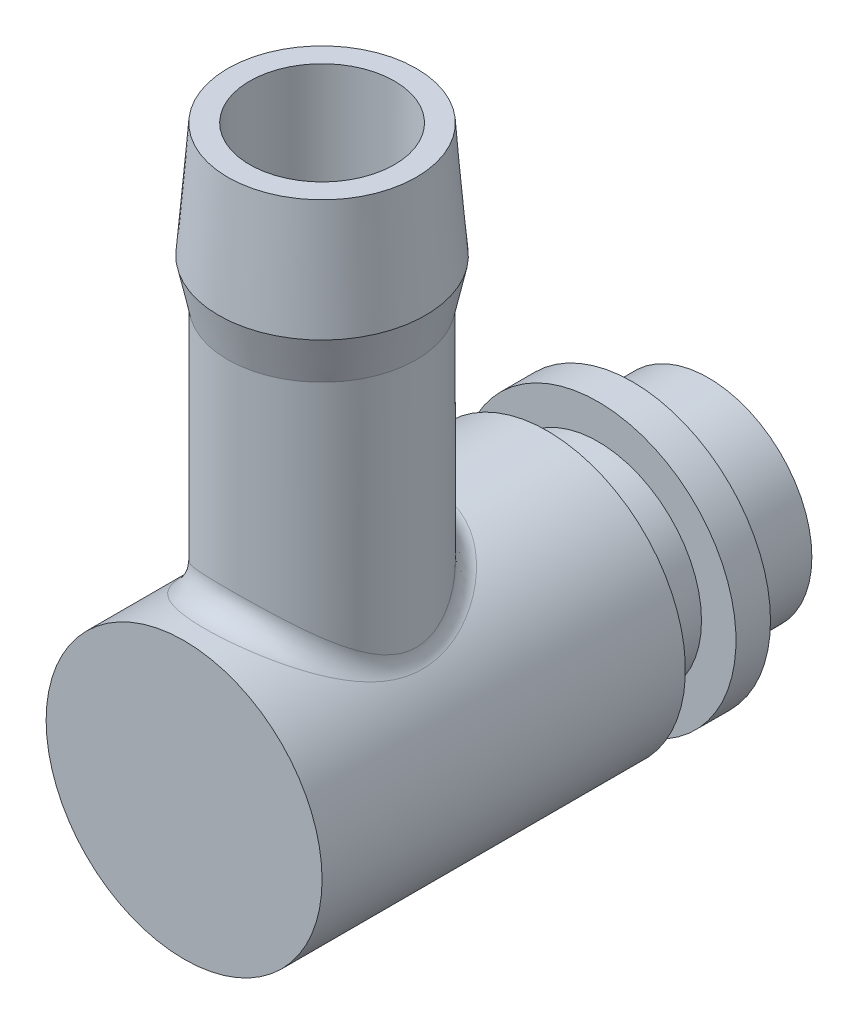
ISO-10303-21;
HEADER;
FILE_DESCRIPTION(('STEP AP214'),'2;1');
FILE_NAME('part.step','',(''),(''),'','','');
FILE_SCHEMA(('AUTOMOTIVE_DESIGN { 1 0 10303 214 1 1 1 1 }'));
ENDSEC;
DATA;
#1=APPLICATION_CONTEXT('core data for automotive mechanical design processes');
#2=APPLICATION_PROTOCOL_DEFINITION('international standard','automotive_design',2000,#1);
#3=PRODUCT_CONTEXT('',#1,'mechanical');
#4=PRODUCT('Part','Part','',(#3));
#5=PRODUCT_RELATED_PRODUCT_CATEGORY('part','',(#4));
#6=PRODUCT_DEFINITION_FORMATION('','',#4);
#7=PRODUCT_DEFINITION_CONTEXT('part definition',#1,'design');
#8=PRODUCT_DEFINITION('design','',#6,#7);
#9=PRODUCT_DEFINITION_SHAPE('','',#8);
#10=(LENGTH_UNIT() NAMED_UNIT(*) SI_UNIT(.MILLI.,.METRE.));
#11=(NAMED_UNIT(*) PLANE_ANGLE_UNIT() SI_UNIT($,.RADIAN.));
#12=(NAMED_UNIT(*) SI_UNIT($,.STERADIAN.) SOLID_ANGLE_UNIT());
#13=UNCERTAINTY_MEASURE_WITH_UNIT(LENGTH_MEASURE(1.E-05),#10,'distance_accuracy_value','');
#14=(GEOMETRIC_REPRESENTATION_CONTEXT(3) GLOBAL_UNCERTAINTY_ASSIGNED_CONTEXT((#13)) GLOBAL_UNIT_ASSIGNED_CONTEXT((#10,
#11,#12)) REPRESENTATION_CONTEXT('',''));
#15=CARTESIAN_POINT('',(0.,0.,0.));
#16=DIRECTION('',(0.,0.,1.));
#17=DIRECTION('',(1.,0.,0.));
#18=AXIS2_PLACEMENT_3D('',#15,#16,#17);
#19=CARTESIAN_POINT('',(0.,0.,19.5));
#20=DIRECTION('',(0.,0.,-1.));
#21=DIRECTION('',(-1.,0.,0.));
#22=AXIS2_PLACEMENT_3D('',#19,#20,#21);
#23=CYLINDRICAL_SURFACE('',#22,6.);
#24=CARTESIAN_POINT('',(-0.169180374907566,5.99761435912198,8.4038208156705));
#25=CARTESIAN_POINT('',(-0.130551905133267,5.99870398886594,9.40198238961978));
#26=CARTESIAN_POINT('',(-0.158675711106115,6.99721675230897,9.40307163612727));
#27=CARTESIAN_POINT('',(0.0357757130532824,6.00339383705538,8.39456243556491));
#28=CARTESIAN_POINT('',(0.0280242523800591,6.00185648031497,9.39716141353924));
#29=CARTESIAN_POINT('',(0.0335543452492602,7.00395947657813,9.39562862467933));
#30=CARTESIAN_POINT('',(0.241609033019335,5.99860532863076,8.40220558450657));
#31=CARTESIAN_POINT('',(0.185281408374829,5.99935491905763,9.40099112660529));
#32=CARTESIAN_POINT('',(0.22660716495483,6.99837288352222,9.40177311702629));
#33=CARTESIAN_POINT('',(0.648810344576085,5.96831379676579,8.45083193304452));
#34=CARTESIAN_POINT('',(0.502998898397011,5.98258117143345,9.42663614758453));
#35=CARTESIAN_POINT('',(0.60852473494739,6.96303276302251,9.44086488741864));
#36=CARTESIAN_POINT('',(0.850176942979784,5.94280440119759,8.49182538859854));
#37=CARTESIAN_POINT('',(0.661973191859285,5.96846274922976,9.44821643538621));
#38=CARTESIAN_POINT('',(0.797388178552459,6.93327180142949,9.47382041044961));
#39=CARTESIAN_POINT('',(1.23919837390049,5.87390086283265,8.60372600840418));
#40=CARTESIAN_POINT('',(0.98007510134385,5.92722510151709,9.51133272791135));
#41=CARTESIAN_POINT('',(1.16225468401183,6.85288433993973,9.563779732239));
#42=CARTESIAN_POINT('',(1.42704133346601,5.83085666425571,8.67404846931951));
#43=CARTESIAN_POINT('',(1.13793412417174,5.90069785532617,9.55196079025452));
#44=CARTESIAN_POINT('',(1.33843419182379,6.80266610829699,9.62031347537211));
#45=CARTESIAN_POINT('',(1.78948723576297,5.73002323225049,8.84133935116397));
#46=CARTESIAN_POINT('',(1.45376171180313,5.83381402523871,9.65517724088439));
#47=CARTESIAN_POINT('',(1.67837528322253,6.68502710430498,9.7548022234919));
#48=CARTESIAN_POINT('',(1.96408741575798,5.67223093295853,8.93831331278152));
#49=CARTESIAN_POINT('',(1.61099407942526,5.79388398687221,9.71709524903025));
#50=CARTESIAN_POINT('',(1.84213427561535,6.61760275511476,9.83276168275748));
#51=CARTESIAN_POINT('',(2.31774096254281,5.53787186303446,9.16865371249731));
#52=CARTESIAN_POINT('',(1.93915775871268,5.69535687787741,9.87230615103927));
#53=CARTESIAN_POINT('',(2.17382894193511,6.46085050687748,10.017937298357));
#54=CARTESIAN_POINT('',(2.49482378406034,5.45988558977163,9.30498754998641));
#55=CARTESIAN_POINT('',(2.10962242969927,5.63548938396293,9.96779113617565));
#56=CARTESIAN_POINT('',(2.33991642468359,6.36986652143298,10.1275390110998));
#57=CARTESIAN_POINT('',(2.82794790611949,5.29502499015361,9.60321794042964));
#58=CARTESIAN_POINT('',(2.43867371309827,5.50232605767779,10.1867653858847));
#59=CARTESIAN_POINT('',(2.65235636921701,6.17752915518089,10.3672928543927));
#60=CARTESIAN_POINT('',(2.98396818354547,5.20814193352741,9.76513968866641));
#61=CARTESIAN_POINT('',(2.5974844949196,5.42939502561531,10.3095068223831));
#62=CARTESIAN_POINT('',(2.7986891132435,6.07616558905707,10.4974652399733));
#63=CARTESIAN_POINT('',(3.21520787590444,5.06682291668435,10.0416433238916));
#64=CARTESIAN_POINT('',(2.83810607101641,5.30602074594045,10.527202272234));
#65=CARTESIAN_POINT('',(3.01557078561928,5.91129340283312,10.7197524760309));
#66=CARTESIAN_POINT('',(3.29760980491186,5.01345572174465,10.1489296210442));
#67=CARTESIAN_POINT('',(2.92456126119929,5.25879370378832,10.6125637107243));
#68=CARTESIAN_POINT('',(3.09285625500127,5.84903167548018,10.8060022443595));
#69=CARTESIAN_POINT('',(3.45428765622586,4.90682051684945,10.3711394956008));
#70=CARTESIAN_POINT('',(3.09033893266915,5.16297499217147,10.7919541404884));
#71=CARTESIAN_POINT('',(3.23980574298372,5.7246239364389,10.9846415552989));
#72=CARTESIAN_POINT('',(3.52857020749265,4.85355246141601,10.4860567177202));
#73=CARTESIAN_POINT('',(3.16982652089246,5.11436836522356,10.8859214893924));
#74=CARTESIAN_POINT('',(3.30947597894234,5.6624778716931,11.0770259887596));
#75=CARTESIAN_POINT('',(3.73906811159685,4.69573791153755,10.8421828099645));
#76=CARTESIAN_POINT('',(3.39509240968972,4.96945822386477,11.1787992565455));
#77=CARTESIAN_POINT('',(3.50690375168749,5.47836089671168,11.3633234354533));
#78=CARTESIAN_POINT('',(3.86302119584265,4.59312524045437,11.0948706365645));
#79=CARTESIAN_POINT('',(3.53168607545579,4.87186715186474,11.3924776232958));
#80=CARTESIAN_POINT('',(3.62316040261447,5.35864611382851,11.566464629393));
#81=CARTESIAN_POINT('',(4.04814948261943,4.4298754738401,11.5625550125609));
#82=CARTESIAN_POINT('',(3.73677265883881,4.71444939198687,11.7946680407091));
#83=CARTESIAN_POINT('',(3.79679379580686,5.16818805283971,11.9424461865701));
#84=CARTESIAN_POINT('',(4.11726996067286,4.36513932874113,11.7713596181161));
#85=CARTESIAN_POINT('',(3.81410521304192,4.65113339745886,11.9758933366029));
#86=CARTESIAN_POINT('',(3.86162247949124,5.09266255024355,12.1103087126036));
#87=CARTESIAN_POINT('',(4.23230995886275,4.253707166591,12.2038296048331));
#88=CARTESIAN_POINT('',(3.94280545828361,4.54178210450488,12.3535421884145));
#89=CARTESIAN_POINT('',(3.96951947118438,4.96265836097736,12.4579806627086));
#90=CARTESIAN_POINT('',(4.27827454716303,4.20697614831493,12.4274651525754));
#91=CARTESIAN_POINT('',(3.99476601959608,4.49530427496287,12.5505353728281));
#92=CARTESIAN_POINT('',(4.01263004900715,4.90813883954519,12.6377661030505));
#93=CARTESIAN_POINT('',(4.32782730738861,4.15577456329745,12.7719031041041));
#94=CARTESIAN_POINT('',(4.0507180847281,4.44436230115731,12.8549762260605));
#95=CARTESIAN_POINT('',(4.05910600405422,4.84840365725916,12.9146672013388));
#96=CARTESIAN_POINT('',(4.34113418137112,4.14182910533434,12.8889992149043));
#97=CARTESIAN_POINT('',(4.06575901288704,4.43045738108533,12.9585868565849));
#98=CARTESIAN_POINT('',(4.07158663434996,4.83213395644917,13.0088032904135));
#99=CARTESIAN_POINT('',(4.36076833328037,4.1211541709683,13.1248784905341));
#100=CARTESIAN_POINT('',(4.08793512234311,4.40985181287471,13.1673953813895));
#101=CARTESIAN_POINT('',(4.09000167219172,4.80801319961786,13.1984317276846));
#102=CARTESIAN_POINT('',(4.36709601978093,4.11442427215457,13.2436615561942));
#103=CARTESIAN_POINT('',(4.09510050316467,4.40312337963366,13.2727296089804));
#104=CARTESIAN_POINT('',(4.09593646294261,4.80016165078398,13.2939239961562));
#105=CARTESIAN_POINT('',(4.37259009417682,4.10858531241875,13.4816444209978));
#106=CARTESIAN_POINT('',(4.10131236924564,4.39729474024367,13.483689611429));
#107=CARTESIAN_POINT('',(4.10108940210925,4.79334953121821,13.4852435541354));
#108=CARTESIAN_POINT('',(4.37176052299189,4.10947195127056,13.6008439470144));
#109=CARTESIAN_POINT('',(4.10037201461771,4.39818217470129,13.5894604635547));
#110=CARTESIAN_POINT('',(4.10031134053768,4.79438394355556,13.5810706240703));
#111=CARTESIAN_POINT('',(4.36298460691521,4.11878591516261,13.8384467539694));
#112=CARTESIAN_POINT('',(4.09045211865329,4.40747701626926,13.8000499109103));
#113=CARTESIAN_POINT('',(4.09208033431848,4.80525023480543,13.772084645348));
#114=CARTESIAN_POINT('',(4.35503864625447,4.12721283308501,13.9568500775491));
#115=CARTESIAN_POINT('',(4.08145939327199,4.41589676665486,13.9050123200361));
#116=CARTESIAN_POINT('',(4.0846277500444,4.81508163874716,13.8672716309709));
#117=CARTESIAN_POINT('',(4.32441985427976,4.15935242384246,14.2719031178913));
#118=CARTESIAN_POINT('',(4.04685451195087,4.44793846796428,14.1839463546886));
#119=CARTESIAN_POINT('',(4.05591012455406,4.85257782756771,14.1205495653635));
#120=CARTESIAN_POINT('',(4.29540053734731,4.18956907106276,14.4668742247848));
#121=CARTESIAN_POINT('',(4.01399835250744,4.47809593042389,14.356344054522));
#122=CARTESIAN_POINT('',(4.02869266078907,4.88783058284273,14.277291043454));
#123=CARTESIAN_POINT('',(4.21943483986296,4.26605499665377,14.8474613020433));
#124=CARTESIAN_POINT('',(3.92862351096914,4.55371087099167,14.6908643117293));
#125=CARTESIAN_POINT('',(3.95744378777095,4.97706416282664,14.5832532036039));
#126=CARTESIAN_POINT('',(4.17246676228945,4.31234369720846,15.0330656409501));
#127=CARTESIAN_POINT('',(3.87579355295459,4.59942588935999,14.8534570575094));
#128=CARTESIAN_POINT('',(3.91339202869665,5.03106764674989,14.7324645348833));
#129=CARTESIAN_POINT('',(4.03423801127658,4.44273658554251,15.4852779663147));
#130=CARTESIAN_POINT('',(3.72123141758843,4.72703069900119,15.247462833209));
#131=CARTESIAN_POINT('',(3.78374610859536,5.18319268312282,15.0960077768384));
#132=CARTESIAN_POINT('',(3.93261087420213,4.53407066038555,15.7447350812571));
#133=CARTESIAN_POINT('',(3.60788681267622,4.81567633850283,15.4708212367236));
#134=CARTESIAN_POINT('',(3.68842915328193,5.28974910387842,15.3045909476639));
#135=CARTESIAN_POINT('',(3.69686343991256,4.72827904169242,16.2363541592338));
#136=CARTESIAN_POINT('',(3.34998401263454,4.9995639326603,15.8866895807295));
#137=CARTESIAN_POINT('',(3.46731963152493,5.51632554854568,15.6998141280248));
#138=CARTESIAN_POINT('',(3.56267444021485,4.83117749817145,16.4684568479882));
#139=CARTESIAN_POINT('',(3.20403432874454,5.09540955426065,16.0794293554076));
#140=CARTESIAN_POINT('',(3.34146262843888,5.63637374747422,15.8864064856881));
#141=CARTESIAN_POINT('',(3.26019738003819,5.04042034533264,16.9094874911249));
#142=CARTESIAN_POINT('',(2.88285452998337,5.28442198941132,16.4371679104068));
#143=CARTESIAN_POINT('',(3.05776682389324,5.88049040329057,16.240960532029));
#144=CARTESIAN_POINT('',(3.09112640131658,5.14678565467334,17.1176727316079));
#145=CARTESIAN_POINT('',(2.70581092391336,5.37755347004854,16.6008443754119));
#146=CARTESIAN_POINT('',(2.89919371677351,6.00458326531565,16.4083251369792));
#147=CARTESIAN_POINT('',(2.72268838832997,5.35081206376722,17.5003219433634));
#148=CARTESIAN_POINT('',(2.33245768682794,5.54901457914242,16.8918940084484));
#149=CARTESIAN_POINT('',(2.55363257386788,6.24261407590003,16.715945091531));
#150=CARTESIAN_POINT('',(2.52336756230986,5.44848608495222,17.6748364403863));
#151=CARTESIAN_POINT('',(2.13540356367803,5.62697036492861,17.0182943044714));
#152=CARTESIAN_POINT('',(2.36668787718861,6.35656709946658,16.8562410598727));
#153=CARTESIAN_POINT('',(2.12869823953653,5.61313547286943,17.9614337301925));
#154=CARTESIAN_POINT('',(1.76157974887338,5.75172561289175,17.2170553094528));
#155=CARTESIAN_POINT('',(1.99652416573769,6.54865805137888,17.0866428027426));
#156=CARTESIAN_POINT('',(1.93726709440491,5.68251865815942,18.078959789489));
#157=CARTESIAN_POINT('',(1.58565395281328,5.80111395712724,17.2940586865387));
#158=CARTESIAN_POINT('',(1.81697926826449,6.62960510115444,17.1811245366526));
#159=CARTESIAN_POINT('',(1.53655983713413,5.8036698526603,18.2813194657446));
#160=CARTESIAN_POINT('',(1.23098829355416,5.88353479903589,17.421719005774));
#161=CARTESIAN_POINT('',(1.44115252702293,6.77094816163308,17.3438058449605));
#162=CARTESIAN_POINT('',(1.32728614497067,5.85544024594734,18.366157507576));
#163=CARTESIAN_POINT('',(1.05313804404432,5.9159490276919,17.4713938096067));
#164=CARTESIAN_POINT('',(1.24487295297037,6.83134695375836,17.4120089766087));
#165=CARTESIAN_POINT('',(1.00324909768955,5.91657027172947,18.4656113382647));
#166=CARTESIAN_POINT('',(0.787483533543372,5.95275783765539,17.5277482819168));
#167=CARTESIAN_POINT('',(0.940955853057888,6.90266531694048,17.4919620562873));
#168=CARTESIAN_POINT('',(0.893048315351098,5.93423284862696,18.494191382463));
#169=CARTESIAN_POINT('',(0.698459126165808,5.96306019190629,17.5435085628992));
#170=CARTESIAN_POINT('',(0.837597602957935,6.92327165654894,17.514938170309));
#171=CARTESIAN_POINT('',(0.6703198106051,5.96349299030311,18.5414093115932));
#172=CARTESIAN_POINT('',(0.520773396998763,5.97986404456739,17.5692087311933));
#173=CARTESIAN_POINT('',(0.628698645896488,6.95740848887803,17.5528976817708));
#174=CARTESIAN_POINT('',(0.557793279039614,5.97509358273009,18.560052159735));
#175=CARTESIAN_POINT('',(0.432343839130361,5.98632096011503,17.5790803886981));
#176=CARTESIAN_POINT('',(0.523159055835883,6.97094251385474,17.5678850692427));
#177=CARTESIAN_POINT('',(0.33158816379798,5.99190272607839,18.5870342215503));
#178=CARTESIAN_POINT('',(0.255880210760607,5.99561800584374,17.5932967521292));
#179=CARTESIAN_POINT('',(0.310999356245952,6.99055318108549,17.5895765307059));
#180=CARTESIAN_POINT('',(0.217912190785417,5.99712344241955,18.5953930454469));
#181=CARTESIAN_POINT('',(0.168097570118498,5.99843806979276,17.5976107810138));
#182=CARTESIAN_POINT('',(0.204381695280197,6.99664401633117,17.5962963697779));
#183=CARTESIAN_POINT('',(-0.00971032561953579,6.00107025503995,18.601714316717));
#184=CARTESIAN_POINT('',(-0.00756882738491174,6.00058247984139,17.6008910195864));
#185=CARTESIAN_POINT('',(-0.0091073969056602,7.0012486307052,17.6013781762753));
#186=CARTESIAN_POINT('',(-0.123656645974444,5.99980055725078,18.5996834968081));
#187=CARTESIAN_POINT('',(-0.095191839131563,5.99990275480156,17.599851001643));
#188=CARTESIAN_POINT('',(-0.115978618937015,6.99976731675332,17.599745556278));
#189=CARTESIAN_POINT('',(-0.30105623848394,5.99278377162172,18.5884389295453));
#190=CARTESIAN_POINT('',(-0.23252148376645,5.99607026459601,17.5939893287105));
#191=CARTESIAN_POINT('',(-0.282363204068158,6.99158106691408,17.5907058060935));
#192=CARTESIAN_POINT('',(-0.364783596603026,5.98923931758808,18.5827576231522));
#193=CARTESIAN_POINT('',(-0.281941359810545,5.99413421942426,17.5910283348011));
#194=CARTESIAN_POINT('',(-0.34213363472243,6.98744587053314,17.5861384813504));
#195=CARTESIAN_POINT('',(-0.491806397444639,5.98014886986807,18.5681679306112));
#196=CARTESIAN_POINT('',(-0.380947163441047,5.98911409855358,17.583351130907));
#197=CARTESIAN_POINT('',(-0.461269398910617,6.97684034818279,17.5744095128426));
#198=CARTESIAN_POINT('',(-0.555101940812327,5.9746033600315,18.5592603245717));
#199=CARTESIAN_POINT('',(-0.430488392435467,5.98603490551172,17.5786423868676));
#200=CARTESIAN_POINT('',(-0.520634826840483,6.97037058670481,17.5672484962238));
#201=CARTESIAN_POINT('',(-0.731447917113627,5.9563367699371,18.5298711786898));
#202=CARTESIAN_POINT('',(-0.569315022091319,5.97577043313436,17.5629476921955));
#203=CARTESIAN_POINT('',(-0.686031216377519,6.94905956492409,17.5436219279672));
#204=CARTESIAN_POINT('',(-0.843858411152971,5.94142221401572,18.5058279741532));
#205=CARTESIAN_POINT('',(-0.658836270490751,5.96727905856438,17.5499659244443));
#206=CARTESIAN_POINT('',(-0.791461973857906,6.93165924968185,17.5242930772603));
#207=CARTESIAN_POINT('',(-1.06585028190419,5.90564547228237,18.4478670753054));
#208=CARTESIAN_POINT('',(-0.838677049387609,5.9462022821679,17.5177153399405));
#209=CARTESIAN_POINT('',(-0.999670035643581,6.88991971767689,17.4776970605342));
#210=CARTESIAN_POINT('',(-1.17542966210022,5.88477920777,18.4139426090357));
#211=CARTESIAN_POINT('',(-0.92877469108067,5.93367115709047,17.4985297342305));
#212=CARTESIAN_POINT('',(-1.10244546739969,6.86557574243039,17.4504244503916));
#213=CARTESIAN_POINT('',(-1.49917259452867,5.81387849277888,18.2979342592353));
#214=CARTESIAN_POINT('',(-1.19901870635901,5.88967890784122,17.4310615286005));
#215=CARTESIAN_POINT('',(-1.40608671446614,6.78285824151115,17.3571628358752));
#216=CARTESIAN_POINT('',(-1.7079538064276,5.7555846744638,18.2016821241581));
#217=CARTESIAN_POINT('',(-1.38038435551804,5.85184658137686,17.372913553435));
#218=CARTESIAN_POINT('',(-1.60190438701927,6.71484878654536,17.279783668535));
#219=CARTESIAN_POINT('',(-2.10432909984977,5.62274995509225,17.977549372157));
#220=CARTESIAN_POINT('',(-1.73869264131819,5.75840852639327,17.227302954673));
#221=CARTESIAN_POINT('',(-1.97366814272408,6.55987494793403,17.0995985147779));
#222=CARTESIAN_POINT('',(-2.292081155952,5.54834453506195,17.8499313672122));
#223=CARTESIAN_POINT('',(-1.91492412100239,5.70359989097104,17.1411347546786));
#224=CARTESIAN_POINT('',(-2.14976239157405,6.47306862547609,16.9970036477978));
#225=CARTESIAN_POINT('',(-2.64620633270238,5.38844277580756,17.5671354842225));
#226=CARTESIAN_POINT('',(-2.25734945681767,5.57866424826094,16.9395267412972));
#227=CARTESIAN_POINT('',(-2.48189940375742,6.2865165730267,16.7696579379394));
#228=CARTESIAN_POINT('',(-2.81258173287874,5.30294762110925,17.4119605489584));
#229=CARTESIAN_POINT('',(-2.42357149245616,5.50902862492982,16.8250001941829));
#230=CARTESIAN_POINT('',(-2.63794430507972,6.18677222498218,16.6449094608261));
#231=CARTESIAN_POINT('',(-3.14379239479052,5.11445060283,17.0547052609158));
#232=CARTESIAN_POINT('',(-2.76068136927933,5.34937812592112,16.5514456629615));
#233=CARTESIAN_POINT('',(-2.94858959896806,5.96685903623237,16.3577042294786));
#234=CARTESIAN_POINT('',(-3.3053848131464,5.01064381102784,16.8491204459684));
#235=CARTESIAN_POINT('',(-2.93057291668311,5.25785260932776,16.3887837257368));
#236=CARTESIAN_POINT('',(-3.10014850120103,5.84575111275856,16.1924301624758));
#237=CARTESIAN_POINT('',(-3.59836003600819,4.80456413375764,16.4092451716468));
#238=CARTESIAN_POINT('',(-3.24251847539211,5.07084705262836,16.0305319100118));
#239=CARTESIAN_POINT('',(-3.37493245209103,5.60532482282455,15.8388049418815));
#240=CARTESIAN_POINT('',(-3.7297261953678,4.70229212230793,16.1749390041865));
#241=CARTESIAN_POINT('',(-3.38577095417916,4.97517139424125,15.835209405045));
#242=CARTESIAN_POINT('',(-3.49814188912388,5.4860074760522,15.6504411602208));
#243=CARTESIAN_POINT('',(-3.94049381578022,4.5263774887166,15.7204639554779));
#244=CARTESIAN_POINT('',(-3.61722939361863,4.80779538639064,15.4490441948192));
#245=CARTESIAN_POINT('',(-3.6958226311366,5.28077373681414,15.2850788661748));
#246=CARTESIAN_POINT('',(-4.02491274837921,4.45080812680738,15.5044929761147));
#247=CARTESIAN_POINT('',(-3.71114307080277,4.73461082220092,15.2632650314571));
#248=CARTESIAN_POINT('',(-3.77499986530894,5.19260948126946,15.1114551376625));
#249=CARTESIAN_POINT('',(-4.16841235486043,4.31671282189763,15.0546962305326));
#250=CARTESIAN_POINT('',(-3.87096200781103,4.60397270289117,14.8730183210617));
#251=CARTESIAN_POINT('',(-3.90958936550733,5.03616495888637,14.7498538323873));
#252=CARTESIAN_POINT('',(-4.22754774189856,4.2581501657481,14.8209103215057));
#253=CARTESIAN_POINT('',(-3.93764288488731,4.54599700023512,14.6680165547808));
#254=CARTESIAN_POINT('',(-3.96505294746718,4.96784186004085,14.5619082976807));
#255=CARTESIAN_POINT('',(-4.30845034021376,4.17611708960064,14.3852742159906));
#256=CARTESIAN_POINT('',(-4.02872366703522,4.46472931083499,14.2843904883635));
#257=CARTESIAN_POINT('',(-4.04093218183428,4.87213660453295,14.2116910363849));
#258=CARTESIAN_POINT('',(-4.33520758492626,4.14807184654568,14.1858921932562));
#259=CARTESIAN_POINT('',(-4.05904659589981,4.43669545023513,14.1078997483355));
#260=CARTESIAN_POINT('',(-4.06602802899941,4.83941715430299,14.0514035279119));
#261=CARTESIAN_POINT('',(-4.36816545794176,4.11336250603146,13.7824052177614));
#262=CARTESIAN_POINT('',(-4.09627048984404,4.40210532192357,13.7507082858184));
#263=CARTESIAN_POINT('',(-4.09693949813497,4.79892292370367,13.7270316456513));
#264=CARTESIAN_POINT('',(-4.3743904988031,4.10667301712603,13.5783061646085));
#265=CARTESIAN_POINT('',(-4.10334625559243,4.3953878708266,13.5693263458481));
#266=CARTESIAN_POINT('',(-4.10277801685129,4.79111851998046,13.5629520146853));
#267=CARTESIAN_POINT('',(-4.36583394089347,4.11576437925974,13.1713961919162));
#268=CARTESIAN_POINT('',(-4.09367293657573,4.40446124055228,13.2086266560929));
#269=CARTESIAN_POINT('',(-4.09475274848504,4.80172510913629,13.2358283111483));
#270=CARTESIAN_POINT('',(-4.35104837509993,4.13154947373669,12.9685855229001));
#271=CARTESIAN_POINT('',(-4.07687998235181,4.42029337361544,13.0285776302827));
#272=CARTESIAN_POINT('',(-4.08088524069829,4.82014105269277,13.0727844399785));
#273=CARTESIAN_POINT('',(-4.30157235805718,4.18302533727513,12.5697223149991));
#274=CARTESIAN_POINT('',(-4.02107156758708,4.47148542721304,12.6761440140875));
#275=CARTESIAN_POINT('',(-4.03448126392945,4.88019622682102,12.752129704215));
#276=CARTESIAN_POINT('',(-4.26684981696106,4.2187481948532,12.3736812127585));
#277=CARTESIAN_POINT('',(-3.98180738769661,4.50706799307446,12.5031391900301));
#278=CARTESIAN_POINT('',(-4.00191469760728,4.92187289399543,12.5945280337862));
#279=CARTESIAN_POINT('',(-4.16397821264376,4.32066460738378,11.9247186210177));
#280=CARTESIAN_POINT('',(-3.86622765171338,4.60765937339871,12.1090494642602));
#281=CARTESIAN_POINT('',(-3.90543054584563,5.04077537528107,12.2335973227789));
#282=CARTESIAN_POINT('',(-4.08835989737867,4.3931608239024,11.6761142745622));
#283=CARTESIAN_POINT('',(-3.78123641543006,4.67899571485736,11.8923195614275));
#284=CARTESIAN_POINT('',(-3.83450748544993,5.12535429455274,12.0337389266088));
#285=CARTESIAN_POINT('',(-3.90847462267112,4.55394136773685,11.2010452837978));
#286=CARTESIAN_POINT('',(-3.58207840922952,4.83414562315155,11.4836138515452));
#287=CARTESIAN_POINT('',(-3.66579155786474,5.31293159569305,11.6518207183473));
#288=CARTESIAN_POINT('',(-3.80415816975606,4.64225287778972,10.9746198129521));
#289=CARTESIAN_POINT('',(-3.46688046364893,4.91856615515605,11.2911428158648));
#290=CARTESIAN_POINT('',(-3.56795227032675,5.41596169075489,11.4697923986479));
#291=CARTESIAN_POINT('',(-3.56590244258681,4.82781715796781,10.5383499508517));
#292=CARTESIAN_POINT('',(-3.20850535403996,5.09182603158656,10.9266830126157));
#293=CARTESIAN_POINT('',(-3.34449019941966,5.63245335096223,11.119065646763));
#294=CARTESIAN_POINT('',(-3.43116619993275,4.92525902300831,10.3292095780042));
#295=CARTESIAN_POINT('',(-3.06361033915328,5.18103502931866,10.7555407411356));
#296=CARTESIAN_POINT('',(-3.21811993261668,5.74613552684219,10.9509331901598));
#297=CARTESIAN_POINT('',(-3.13548745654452,5.11859779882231,9.93672707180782));
#298=CARTESIAN_POINT('',(-2.75316023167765,5.35268300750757,10.4420703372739));
#299=CARTESIAN_POINT('',(-2.94080032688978,5.97169743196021,10.6354080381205));
#300=CARTESIAN_POINT('',(-2.97453358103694,5.21449401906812,9.75339620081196));
#301=CARTESIAN_POINT('',(-2.58669602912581,5.43512589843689,10.3001860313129));
#302=CARTESIAN_POINT('',(-2.78984031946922,6.08357635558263,10.4880243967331));
#303=CARTESIAN_POINT('',(-2.59426165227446,5.41517279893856,9.38325126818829));
#304=CARTESIAN_POINT('',(-2.20454909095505,5.60135323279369,10.0221377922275));
#305=CARTESIAN_POINT('',(-2.43318004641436,6.31770159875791,10.1904569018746));
#306=CARTESIAN_POINT('',(-2.36966195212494,5.51821215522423,9.20232094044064));
#307=CARTESIAN_POINT('',(-1.98598735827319,5.68132304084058,9.89436554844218));
#308=CARTESIAN_POINT('',(-2.22252607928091,6.43791418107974,10.0450031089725));
#309=CARTESIAN_POINT('',(-2.0090486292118,5.65511599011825,8.96767296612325));
#310=CARTESIAN_POINT('',(-1.65362607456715,5.78107033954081,9.7373054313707));
#311=CARTESIAN_POINT('',(-1.8843037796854,6.59763532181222,9.85636454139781));
#312=CARTESIAN_POINT('',(-1.88492421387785,5.6978000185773,8.89559433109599));
#313=CARTESIAN_POINT('',(-1.54088625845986,5.81112926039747,9.69046209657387));
#314=CARTESIAN_POINT('',(-1.76788643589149,6.64743335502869,9.79841897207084));
#315=CARTESIAN_POINT('',(-1.6295024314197,5.77603131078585,8.7647776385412));
#316=CARTESIAN_POINT('',(-1.31422311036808,5.86452779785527,9.60769095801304));
#317=CARTESIAN_POINT('',(-1.52832417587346,6.73870319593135,9.69325261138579));
#318=CARTESIAN_POINT('',(-1.49820869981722,5.81158214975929,8.70603289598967));
#319=CARTESIAN_POINT('',(-1.20052395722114,5.88770946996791,9.57201549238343));
#320=CARTESIAN_POINT('',(-1.40518266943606,6.78017917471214,9.64602644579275));
#321=CARTESIAN_POINT('',(-1.17374404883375,5.88730148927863,8.58174864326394));
#322=CARTESIAN_POINT('',(-0.925213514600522,5.93576547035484,9.49821180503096));
#323=CARTESIAN_POINT('',(-1.10086451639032,6.86851840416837,9.54611165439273));
#324=CARTESIAN_POINT('',(-0.977469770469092,5.92328282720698,8.52347416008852));
#325=CARTESIAN_POINT('',(-0.765158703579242,5.95682412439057,9.46602163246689));
#326=CARTESIAN_POINT('',(-0.916777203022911,6.91049663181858,9.49926354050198));
#327=CARTESIAN_POINT('',(-0.577477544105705,5.97554648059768,8.43914458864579));
#328=CARTESIAN_POINT('',(-0.44608449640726,5.98685307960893,9.42010964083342));
#329=CARTESIAN_POINT('',(-0.541621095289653,6.97147089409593,9.43146917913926));
#330=CARTESIAN_POINT('',(-0.373765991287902,5.99184532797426,8.41306246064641));
#331=CARTESIAN_POINT('',(-0.288424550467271,5.99556548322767,9.40678197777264));
#332=CARTESIAN_POINT('',(-0.350558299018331,6.99048621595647,9.41050119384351));
#333=CARTESIAN_POINT('',(-0.169180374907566,5.99761435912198,8.4038208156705));
#334=CARTESIAN_POINT('',(-0.130551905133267,5.99870398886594,9.40198238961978));
#335=CARTESIAN_POINT('',(-0.158675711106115,6.99721675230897,9.40307163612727));
#336=(BOUNDED_SURFACE() B_SPLINE_SURFACE(3,2,((#24,#25,#26),(#27,#28,#29),(#30,#31,#32),(#33,
#34,#35),(#36,#37,#38),(#39,#40,#41),(#42,#43,#44),(#45,#46,#47),(#48,#49,#50),(#51,#52,#53),
(#54,#55,#56),(#57,#58,#59),(#60,#61,#62),(#63,#64,#65),(#66,#67,#68),(#69,#70,#71),(#72,#73,
#74),(#75,#76,#77),(#78,#79,#80),(#81,#82,#83),(#84,#85,#86),(#87,#88,#89),(#90,#91,#92),(#93,
#94,#95),(#96,#97,#98),(#99,#100,#101),(#102,#103,#104),(#105,#106,#107),(#108,#109,#110),(#111,
#112,#113),(#114,#115,#116),(#117,#118,#119),(#120,#121,#122),(#123,#124,#125),(#126,#127,#128),
(#129,#130,#131),(#132,#133,#134),(#135,#136,#137),(#138,#139,#140),(#141,#142,#143),(#144,#145,
#146),(#147,#148,#149),(#150,#151,#152),(#153,#154,#155),(#156,#157,#158),(#159,#160,#161),
(#162,#163,#164),(#165,#166,#167),(#168,#169,#170),(#171,#172,#173),(#174,#175,#176),(#177,#178,
#179),(#180,#181,#182),(#183,#184,#185),(#186,#187,#188),(#189,#190,#191),(#192,#193,#194),
(#195,#196,#197),(#198,#199,#200),(#201,#202,#203),(#204,#205,#206),(#207,#208,#209),(#210,#211,
#212),(#213,#214,#215),(#216,#217,#218),(#219,#220,#221),(#222,#223,#224),(#225,#226,#227),
(#228,#229,#230),(#231,#232,#233),(#234,#235,#236),(#237,#238,#239),(#240,#241,#242),(#243,#244,
#245),(#246,#247,#248),(#249,#250,#251),(#252,#253,#254),(#255,#256,#257),(#258,#259,#260),
(#261,#262,#263),(#264,#265,#266),(#267,#268,#269),(#270,#271,#272),(#273,#274,#275),(#276,#277,
#278),(#279,#280,#281),(#282,#283,#284),(#285,#286,#287),(#288,#289,#290),(#291,#292,#293),
(#294,#295,#296),(#297,#298,#299),(#300,#301,#302),(#303,#304,#305),(#306,#307,#308),(#309,#310,
#311),(#312,#313,#314),(#315,#316,#317),(#318,#319,#320),(#321,#322,#323),(#324,#325,#326),
(#327,#328,#329),(#330,#331,#332),(#333,#334,#335)),.UNSPECIFIED.,.T.,.F.,
.F.) B_SPLINE_SURFACE_WITH_KNOTS((4,2,2,2,2,2,2,2,2,2,2,2,2,2,2,2,2,2,2,2,2,2,2,2,2,2,2,2,2,2,2,
2,2,2,2,2,2,2,2,2,2,2,2,2,2,2,2,2,2,2,2,4),(3,3),(0.,0.71730112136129,1.43482291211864,
2.13867658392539,2.84267669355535,3.63098151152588,4.42006743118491,4.89043189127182,
5.36040941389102,6.29988946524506,7.00639916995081,7.71152843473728,8.06873775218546,
8.42592615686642,8.78291290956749,9.13988038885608,9.74017280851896,10.3411931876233,
11.2497687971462,12.1602783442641,13.0940275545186,14.0263645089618,14.8183760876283,
15.6102804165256,16.0097153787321,16.4089506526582,16.8074234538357,17.2056380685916,
17.4295805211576,17.6534688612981,18.0561836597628,18.4591751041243,19.2665152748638,
20.0673134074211,20.868026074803,21.776882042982,22.6862373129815,23.4433866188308,
24.1988890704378,24.8095764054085,25.4195373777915,26.0296135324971,26.6406744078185,
27.4671954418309,28.2951509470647,29.1480219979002,30.001264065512,31.0156819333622,
31.5226499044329,32.0293631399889,32.7459700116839,33.461974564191),(0.,1.),
.UNSPECIFIED.) GEOMETRIC_REPRESENTATION_ITEM() RATIONAL_B_SPLINE_SURFACE(((1.,0.70749249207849,
1.),(1.,0.706558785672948,1.),(1.,0.707340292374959,1.),(1.,0.712206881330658,1.),(1.,
0.716292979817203,1.),(1.,0.727043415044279,1.),(1.,0.733657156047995,1.),(1.,0.748648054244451,
1.),(1.,0.757025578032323,1.),(1.,0.775781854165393,1.),(1.,0.786280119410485,1.),(1.,
0.807487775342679,1.),(1.,0.81819736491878,1.),(1.,0.834843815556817,1.),(1.,0.840961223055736,
1.),(1.,0.85286715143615,1.),(1.,0.858655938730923,1.),(1.,0.875364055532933,1.),(1.,
0.885631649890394,1.),(1.,0.901290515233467,1.),(1.,0.907259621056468,1.),(1.,0.917294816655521,
1.),(1.,0.921364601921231,1.),(1.,0.925771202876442,1.),(1.,0.92695909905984,1.),(1.,
0.928714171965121,1.),(1.,0.929281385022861,1.),(1.,0.929773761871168,1.),(1.,0.929699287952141,
1.),(1.,0.928913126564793,1.),(1.,0.928201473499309,1.),(1.,0.925466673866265,1.),(1.,
0.922880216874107,1.),(1.,0.916175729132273,1.),(1.,0.912055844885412,1.),(1.,0.900096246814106,
1.),(1.,0.891431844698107,1.),(1.,0.871987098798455,1.),(1.,0.861202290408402,1.),(1.,
0.83803898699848,1.),(1.,0.825626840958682,1.),(1.,0.800517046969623,1.),(1.,0.787819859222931,
1.),(1.,0.765416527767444,1.),(1.,0.755547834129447,1.),(1.,0.737785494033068,1.),(1.,
0.729891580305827,1.),(1.,0.720396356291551,1.),(1.,0.717615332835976,1.),(1.,0.712976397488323,
1.),(1.,0.711118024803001,1.),(1.,0.708416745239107,1.),(1.,0.70757190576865,1.),(1.,
0.706933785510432,1.),(1.,0.707139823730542,1.),(1.,0.708272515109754,1.),(1.,0.708844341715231,
1.),(1.,0.710305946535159,1.),(1.,0.711195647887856,1.),(1.,0.714113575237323,1.),(1.,
0.716483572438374,1.),(1.,0.722100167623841,1.),(1.,0.725347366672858,1.),(1.,0.736213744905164,
1.),(1.,0.744950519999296,1.),(1.,0.764040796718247,1.),(1.,0.774380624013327,1.),(1.,
0.79561547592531,1.),(1.,0.80651044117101,1.),(1.,0.829437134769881,1.),(1.,0.841423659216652,
1.),(1.,0.864033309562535,1.),(1.,0.874655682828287,1.),(1.,0.892128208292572,1.),(1.,
0.89931215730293,1.),(1.,0.911688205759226,1.),(1.,0.916884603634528,1.),(1.,0.9240403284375,
1.),(1.,0.926429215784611,1.),(1.,0.929375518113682,1.),(1.,0.929935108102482,1.),(1.,
0.929168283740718,1.),(1.,0.927841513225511,1.),(1.,0.923433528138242,1.),(1.,0.92034948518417,
1.),(1.,0.911312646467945,1.),(1.,0.904731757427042,1.),(1.,0.889447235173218,1.),(1.,
0.880739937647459,1.),(1.,0.861520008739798,1.),(1.,0.850960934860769,1.),(1.,0.828926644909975,
1.),(1.,0.817451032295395,1.),(1.,0.792257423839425,1.),(1.,0.778525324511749,1.),(1.,
0.75941526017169,1.),(1.,0.75329453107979,1.),(1.,0.74184862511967,1.),(1.,0.736523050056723,
1.),(1.,0.724998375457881,1.),(1.,0.719351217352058,1.),(1.,0.711065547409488,1.),(1.,
0.708424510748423,1.),(1.,0.70749249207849,1.))) REPRESENTATION_ITEM('') SURFACE());
#337=CARTESIAN_POINT('',(-0.169180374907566,5.99761435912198,8.4038208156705));
#338=CARTESIAN_POINT('',(0.0357757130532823,6.00339383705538,8.39456243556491));
#339=CARTESIAN_POINT('',(0.241609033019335,5.99860532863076,8.40220558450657));
#340=CARTESIAN_POINT('',(0.648810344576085,5.96831379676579,8.45083193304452));
#341=CARTESIAN_POINT('',(0.850176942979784,5.94280440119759,8.49182538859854));
#342=CARTESIAN_POINT('',(1.23919837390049,5.87390086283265,8.60372600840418));
#343=CARTESIAN_POINT('',(1.42704133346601,5.83085666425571,8.67404846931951));
#344=CARTESIAN_POINT('',(1.78948723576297,5.73002323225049,8.84133935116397));
#345=CARTESIAN_POINT('',(1.96408741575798,5.67223093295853,8.93831331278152));
#346=CARTESIAN_POINT('',(2.31774096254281,5.53787186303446,9.16865371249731));
#347=CARTESIAN_POINT('',(2.49482378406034,5.45988558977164,9.30498754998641));
#348=CARTESIAN_POINT('',(2.8279479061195,5.29502499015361,9.60321794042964));
#349=CARTESIAN_POINT('',(2.98396818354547,5.20814193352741,9.76513968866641));
#350=CARTESIAN_POINT('',(3.21520787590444,5.06682291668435,10.0416433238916));
#351=CARTESIAN_POINT('',(3.29760980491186,5.01345572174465,10.1489296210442));
#352=CARTESIAN_POINT('',(3.45428765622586,4.90682051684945,10.3711394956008));
#353=CARTESIAN_POINT('',(3.52857020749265,4.85355246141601,10.4860567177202));
#354=CARTESIAN_POINT('',(3.73906811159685,4.69573791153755,10.8421828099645));
#355=CARTESIAN_POINT('',(3.86302119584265,4.59312524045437,11.0948706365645));
#356=CARTESIAN_POINT('',(4.04814948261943,4.4298754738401,11.5625550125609));
#357=CARTESIAN_POINT('',(4.11726996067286,4.36513932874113,11.7713596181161));
#358=CARTESIAN_POINT('',(4.23230995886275,4.253707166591,12.2038296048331));
#359=CARTESIAN_POINT('',(4.27827454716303,4.20697614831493,12.4274651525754));
#360=CARTESIAN_POINT('',(4.32782730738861,4.15577456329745,12.7719031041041));
#361=CARTESIAN_POINT('',(4.34113418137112,4.14182910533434,12.8889992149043));
#362=CARTESIAN_POINT('',(4.36076833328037,4.12115417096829,13.1248784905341));
#363=CARTESIAN_POINT('',(4.36709601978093,4.11442427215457,13.2436615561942));
#364=CARTESIAN_POINT('',(4.37259009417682,4.10858531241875,13.4816444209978));
#365=CARTESIAN_POINT('',(4.37176052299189,4.10947195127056,13.6008439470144));
#366=CARTESIAN_POINT('',(4.36298460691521,4.11878591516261,13.8384467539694));
#367=CARTESIAN_POINT('',(4.35503864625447,4.12721283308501,13.9568500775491));
#368=CARTESIAN_POINT('',(4.32441985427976,4.15935242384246,14.2719031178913));
#369=CARTESIAN_POINT('',(4.29540053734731,4.18956907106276,14.4668742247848));
#370=CARTESIAN_POINT('',(4.21943483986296,4.26605499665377,14.8474613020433));
#371=CARTESIAN_POINT('',(4.17246676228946,4.31234369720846,15.0330656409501));
#372=CARTESIAN_POINT('',(4.03423801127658,4.44273658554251,15.4852779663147));
#373=CARTESIAN_POINT('',(3.93261087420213,4.53407066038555,15.7447350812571));
#374=CARTESIAN_POINT('',(3.69686343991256,4.72827904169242,16.2363541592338));
#375=CARTESIAN_POINT('',(3.56267444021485,4.83117749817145,16.4684568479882));
#376=CARTESIAN_POINT('',(3.26019738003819,5.04042034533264,16.9094874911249));
#377=CARTESIAN_POINT('',(3.09112640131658,5.14678565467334,17.1176727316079));
#378=CARTESIAN_POINT('',(2.72268838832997,5.35081206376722,17.5003219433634));
#379=CARTESIAN_POINT('',(2.52336756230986,5.44848608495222,17.6748364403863));
#380=CARTESIAN_POINT('',(2.12869823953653,5.61313547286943,17.9614337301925));
#381=CARTESIAN_POINT('',(1.93726709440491,5.68251865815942,18.078959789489));
#382=CARTESIAN_POINT('',(1.53655983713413,5.8036698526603,18.2813194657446));
#383=CARTESIAN_POINT('',(1.32728614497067,5.85544024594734,18.366157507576));
#384=CARTESIAN_POINT('',(1.00324909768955,5.91657027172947,18.4656113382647));
#385=CARTESIAN_POINT('',(0.893048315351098,5.93423284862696,18.494191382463));
#386=CARTESIAN_POINT('',(0.6703198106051,5.96349299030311,18.5414093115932));
#387=CARTESIAN_POINT('',(0.557793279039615,5.97509358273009,18.560052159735));
#388=CARTESIAN_POINT('',(0.33158816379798,5.99190272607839,18.5870342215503));
#389=CARTESIAN_POINT('',(0.217912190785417,5.99712344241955,18.5953930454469));
#390=CARTESIAN_POINT('',(-0.00971032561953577,6.00107025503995,18.601714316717));
#391=CARTESIAN_POINT('',(-0.123656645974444,5.99980055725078,18.5996834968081));
#392=CARTESIAN_POINT('',(-0.30105623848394,5.99278377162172,18.5884389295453));
#393=CARTESIAN_POINT('',(-0.364783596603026,5.98923931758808,18.5827576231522));
#394=CARTESIAN_POINT('',(-0.491806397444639,5.98014886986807,18.5681679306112));
#395=CARTESIAN_POINT('',(-0.555101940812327,5.9746033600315,18.5592603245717));
#396=CARTESIAN_POINT('',(-0.731447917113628,5.9563367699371,18.5298711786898));
#397=CARTESIAN_POINT('',(-0.843858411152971,5.94142221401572,18.5058279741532));
#398=CARTESIAN_POINT('',(-1.06585028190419,5.90564547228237,18.4478670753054));
#399=CARTESIAN_POINT('',(-1.17542966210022,5.88477920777,18.4139426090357));
#400=CARTESIAN_POINT('',(-1.49917259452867,5.81387849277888,18.2979342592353));
#401=CARTESIAN_POINT('',(-1.7079538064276,5.7555846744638,18.2016821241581));
#402=CARTESIAN_POINT('',(-2.10432909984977,5.62274995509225,17.977549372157));
#403=CARTESIAN_POINT('',(-2.292081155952,5.54834453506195,17.8499313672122));
#404=CARTESIAN_POINT('',(-2.64620633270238,5.38844277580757,17.5671354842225));
#405=CARTESIAN_POINT('',(-2.81258173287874,5.30294762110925,17.4119605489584));
#406=CARTESIAN_POINT('',(-3.14379239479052,5.11445060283,17.0547052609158));
#407=CARTESIAN_POINT('',(-3.3053848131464,5.01064381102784,16.8491204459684));
#408=CARTESIAN_POINT('',(-3.59836003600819,4.80456413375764,16.4092451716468));
#409=CARTESIAN_POINT('',(-3.7297261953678,4.70229212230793,16.1749390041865));
#410=CARTESIAN_POINT('',(-3.94049381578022,4.5263774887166,15.7204639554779));
#411=CARTESIAN_POINT('',(-4.02491274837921,4.45080812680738,15.5044929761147));
#412=CARTESIAN_POINT('',(-4.16841235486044,4.31671282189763,15.0546962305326));
#413=CARTESIAN_POINT('',(-4.22754774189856,4.2581501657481,14.8209103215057));
#414=CARTESIAN_POINT('',(-4.30845034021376,4.17611708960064,14.3852742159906));
#415=CARTESIAN_POINT('',(-4.33520758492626,4.14807184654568,14.1858921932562));
#416=CARTESIAN_POINT('',(-4.36816545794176,4.11336250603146,13.7824052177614));
#417=CARTESIAN_POINT('',(-4.3743904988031,4.10667301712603,13.5783061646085));
#418=CARTESIAN_POINT('',(-4.36583394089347,4.11576437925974,13.1713961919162));
#419=CARTESIAN_POINT('',(-4.35104837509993,4.13154947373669,12.9685855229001));
#420=CARTESIAN_POINT('',(-4.30157235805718,4.18302533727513,12.5697223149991));
#421=CARTESIAN_POINT('',(-4.26684981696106,4.2187481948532,12.3736812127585));
#422=CARTESIAN_POINT('',(-4.16397821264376,4.32066460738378,11.9247186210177));
#423=CARTESIAN_POINT('',(-4.08835989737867,4.3931608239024,11.6761142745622));
#424=CARTESIAN_POINT('',(-3.90847462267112,4.55394136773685,11.2010452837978));
#425=CARTESIAN_POINT('',(-3.80415816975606,4.64225287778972,10.9746198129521));
#426=CARTESIAN_POINT('',(-3.56590244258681,4.82781715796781,10.5383499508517));
#427=CARTESIAN_POINT('',(-3.43116619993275,4.92525902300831,10.3292095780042));
#428=CARTESIAN_POINT('',(-3.13548745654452,5.11859779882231,9.93672707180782));
#429=CARTESIAN_POINT('',(-2.97453358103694,5.21449401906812,9.75339620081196));
#430=CARTESIAN_POINT('',(-2.59426165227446,5.41517279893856,9.38325126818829));
#431=CARTESIAN_POINT('',(-2.36966195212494,5.51821215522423,9.20232094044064));
#432=CARTESIAN_POINT('',(-2.0090486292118,5.65511599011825,8.96767296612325));
#433=CARTESIAN_POINT('',(-1.88492421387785,5.6978000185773,8.89559433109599));
#434=CARTESIAN_POINT('',(-1.6295024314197,5.77603131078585,8.7647776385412));
#435=CARTESIAN_POINT('',(-1.49820869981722,5.81158214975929,8.70603289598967));
#436=CARTESIAN_POINT('',(-1.17374404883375,5.88730148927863,8.58174864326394));
#437=CARTESIAN_POINT('',(-0.977469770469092,5.92328282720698,8.52347416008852));
#438=CARTESIAN_POINT('',(-0.577477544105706,5.97554648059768,8.43914458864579));
#439=CARTESIAN_POINT('',(-0.373765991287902,5.99184532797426,8.41306246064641));
#440=CARTESIAN_POINT('',(-0.169180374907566,5.99761435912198,8.4038208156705));
#441=B_SPLINE_CURVE_WITH_KNOTS('',3,(#337,#338,#339,#340,#341,#342,#343,#344,#345,#346,#347,
#348,#349,#350,#351,#352,#353,#354,#355,#356,#357,#358,#359,#360,#361,#362,#363,#364,#365,#366,
#367,#368,#369,#370,#371,#372,#373,#374,#375,#376,#377,#378,#379,#380,#381,#382,#383,#384,#385,
#386,#387,#388,#389,#390,#391,#392,#393,#394,#395,#396,#397,#398,#399,#400,#401,#402,#403,#404,
#405,#406,#407,#408,#409,#410,#411,#412,#413,#414,#415,#416,#417,#418,#419,#420,#421,#422,#423,
#424,#425,#426,#427,#428,#429,#430,#431,#432,#433,#434,#435,#436,#437,#438,#439,#440),
.UNSPECIFIED.,.T.,.F.,(4,2,2,2,2,2,2,2,2,2,2,2,2,2,2,2,2,2,2,2,2,2,2,2,2,2,2,2,2,2,2,2,2,2,2,2,
2,2,2,2,2,2,2,2,2,2,2,2,2,2,2,4),(0.,0.71730112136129,1.43482291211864,2.13867658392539,
2.84267669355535,3.63098151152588,4.42006743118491,4.89043189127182,5.36040941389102,
6.29988946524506,7.00639916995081,7.71152843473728,8.06873775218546,8.42592615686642,
8.78291290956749,9.13988038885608,9.74017280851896,10.3411931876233,11.2497687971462,
12.1602783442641,13.0940275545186,14.0263645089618,14.8183760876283,15.6102804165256,
16.0097153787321,16.4089506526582,16.8074234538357,17.2056380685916,17.4295805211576,
17.6534688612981,18.0561836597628,18.4591751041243,19.2665152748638,20.0673134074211,
20.868026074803,21.776882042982,22.6862373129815,23.4433866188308,24.1988890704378,
24.8095764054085,25.4195373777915,26.0296135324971,26.6406744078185,27.4671954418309,
28.2951509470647,29.1480219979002,30.001264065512,31.0156819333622,31.5226499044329,
32.0293631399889,32.7459700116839,33.461974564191),.UNSPECIFIED.);
#442=CARTESIAN_POINT('',(-0.169180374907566,5.99761435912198,8.4038208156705));
#443=VERTEX_POINT('',#442);
#444=EDGE_CURVE('E49',#443,#443,#441,.T.);
#445=ORIENTED_EDGE('',*,*,#444,.T.);
#446=EDGE_LOOP('',(#445));
#447=FACE_BOUND('',#446,.T.);
#448=CARTESIAN_POINT('',(0.,0.,19.5));
#449=DIRECTION('',(0.,0.,1.));
#450=DIRECTION('',(1.,0.,0.));
#451=AXIS2_PLACEMENT_3D('',#448,#449,#450);
#452=CIRCLE('',#451,6.);
#453=CARTESIAN_POINT('',(6.,0.,19.5));
#454=VERTEX_POINT('',#453);
#455=EDGE_CURVE('E77',#454,#454,#452,.T.);
#456=ORIENTED_EDGE('',*,*,#455,.F.);
#457=EDGE_LOOP('',(#456));
#458=FACE_BOUND('',#457,.T.);
#459=CARTESIAN_POINT('',(0.,0.,3.7));
#460=DIRECTION('',(0.,0.,-1.));
#461=DIRECTION('',(-1.,0.,0.));
#462=AXIS2_PLACEMENT_3D('',#459,#460,#461);
#463=CIRCLE('',#462,6.);
#464=CARTESIAN_POINT('',(-6.,0.,3.7));
#465=VERTEX_POINT('',#464);
#466=EDGE_CURVE('E186',#465,#465,#463,.T.);
#467=ORIENTED_EDGE('',*,*,#466,.F.);
#468=EDGE_LOOP('',(#467));
#469=FACE_BOUND('',#468,.T.);
#470=ADVANCED_FACE('F37',(#447,#458,#469),#23,.T.);
#471=CARTESIAN_POINT('',(0.,0.,19.5));
#472=DIRECTION('',(0.,0.,1.));
#473=DIRECTION('',(1.,0.,0.));
#474=AXIS2_PLACEMENT_3D('',#471,#472,#473);
#475=PLANE('',#474);
#476=ORIENTED_EDGE('',*,*,#455,.T.);
#477=EDGE_LOOP('',(#476));
#478=FACE_BOUND('',#477,.T.);
#479=ADVANCED_FACE('F107',(#478),#475,.T.);
#480=CARTESIAN_POINT('',(0.,0.,13.5));
#481=DIRECTION('',(0.,-1.,0.));
#482=DIRECTION('',(0.,0.,-1.));
#483=AXIS2_PLACEMENT_3D('',#480,#481,#482);
#484=CYLINDRICAL_SURFACE('',#483,3.15);
#485=CARTESIAN_POINT('',(0.,22.5,13.5));
#486=DIRECTION('',(0.,-1.,0.));
#487=DIRECTION('',(0.,0.,-1.));
#488=AXIS2_PLACEMENT_3D('',#485,#486,#487);
#489=CIRCLE('',#488,3.15);
#490=CARTESIAN_POINT('',(0.,22.5,10.35));
#491=VERTEX_POINT('',#490);
#492=EDGE_CURVE('E72',#491,#491,#489,.T.);
#493=ORIENTED_EDGE('',*,*,#492,.F.);
#494=EDGE_LOOP('',(#493));
#495=FACE_BOUND('',#494,.T.);
#496=CARTESIAN_POINT('',(0.,6.,10.35));
#497=CARTESIAN_POINT('',(-0.0823324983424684,5.99999964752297,10.3500004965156));
#498=CARTESIAN_POINT('',(-0.164665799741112,5.99829995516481,10.3532336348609));
#499=CARTESIAN_POINT('',(-0.328700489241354,5.9915536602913,10.3661143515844));
#500=CARTESIAN_POINT('',(-0.410401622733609,5.9865057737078,10.375764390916));
#501=CARTESIAN_POINT('',(-0.653800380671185,5.96648521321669,10.4142308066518));
#502=CARTESIAN_POINT('',(-0.813714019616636,5.94663580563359,10.452563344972));
#503=CARTESIAN_POINT('',(-1.12330743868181,5.89599682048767,10.5526099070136));
#504=CARTESIAN_POINT('',(-1.27302544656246,5.86525113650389,10.6142301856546));
#505=CARTESIAN_POINT('',(-1.55977162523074,5.79559191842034,10.7585803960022));
#506=CARTESIAN_POINT('',(-1.69679999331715,5.75667851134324,10.8413099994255));
#507=CARTESIAN_POINT('',(-1.96421143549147,5.67122916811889,11.0315951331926));
#508=CARTESIAN_POINT('',(-2.09359054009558,5.62436290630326,11.1404108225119));
#509=CARTESIAN_POINT('',(-2.33319345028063,5.52927253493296,11.3770024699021));
#510=CARTESIAN_POINT('',(-2.44340104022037,5.48104731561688,11.5047943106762));
#511=CARTESIAN_POINT('',(-2.65131209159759,5.3837578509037,11.7892503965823));
#512=CARTESIAN_POINT('',(-2.7470722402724,5.33499071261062,11.9474636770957));
#513=CARTESIAN_POINT('',(-2.86938934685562,5.26960634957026,12.1970354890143));
#514=CARTESIAN_POINT('',(-2.90661659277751,5.24910048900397,12.2822981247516));
#515=CARTESIAN_POINT('',(-2.97357007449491,5.21146377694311,12.4564179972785));
#516=CARTESIAN_POINT('',(-3.0033009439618,5.19433084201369,12.5452729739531));
#517=CARTESIAN_POINT('',(-3.05327075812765,5.16510651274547,12.7203763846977));
#518=CARTESIAN_POINT('',(-3.07398055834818,5.15277009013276,12.8064496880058));
#519=CARTESIAN_POINT('',(-3.10812614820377,5.13224603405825,12.9804729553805));
#520=CARTESIAN_POINT('',(-3.12156599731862,5.12405608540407,13.0684218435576));
#521=CARTESIAN_POINT('',(-3.14095265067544,5.11219616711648,13.2453856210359));
#522=CARTESIAN_POINT('',(-3.14690515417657,5.10852275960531,13.3343996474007));
#523=CARTESIAN_POINT('',(-3.15123795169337,5.10584914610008,13.5126512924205));
#524=CARTESIAN_POINT('',(-3.14961910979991,5.10684840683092,13.6018888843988));
#525=CARTESIAN_POINT('',(-3.13487399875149,5.11593128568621,13.8445357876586));
#526=CARTESIAN_POINT('',(-3.11423235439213,5.12864021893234,13.9973968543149));
#527=CARTESIAN_POINT('',(-3.05137115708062,5.16627761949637,14.2969498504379));
#528=CARTESIAN_POINT('',(-3.00914343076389,5.19121071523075,14.4436394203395));
#529=CARTESIAN_POINT('',(-2.90364193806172,5.25096195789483,14.7309826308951));
#530=CARTESIAN_POINT('',(-2.83991050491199,5.28599241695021,14.8714225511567));
#531=CARTESIAN_POINT('',(-2.69357529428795,5.36203720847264,15.1403103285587));
#532=CARTESIAN_POINT('',(-2.61096308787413,5.40305421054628,15.2687527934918));
#533=CARTESIAN_POINT('',(-2.41559087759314,5.49345681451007,15.5291699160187));
#534=CARTESIAN_POINT('',(-2.30021761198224,5.54320463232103,15.6590657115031));
#535=CARTESIAN_POINT('',(-2.04924696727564,5.64080886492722,15.8985825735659));
#536=CARTESIAN_POINT('',(-1.91363803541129,5.6886641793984,16.0081919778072));
#537=CARTESIAN_POINT('',(-1.61650205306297,5.78034531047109,16.2098731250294));
#538=CARTESIAN_POINT('',(-1.45394837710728,5.82379498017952,16.3006176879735));
#539=CARTESIAN_POINT('',(-1.11303516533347,5.89843158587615,16.4526940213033));
#540=CARTESIAN_POINT('',(-0.934689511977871,5.92962916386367,16.5140513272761));
#541=CARTESIAN_POINT('',(-0.584095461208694,5.97388101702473,16.6001590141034));
#542=CARTESIAN_POINT('',(-0.412696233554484,5.98829261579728,16.6276603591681));
#543=CARTESIAN_POINT('',(-0.067141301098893,6.00211004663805,16.6540397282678));
#544=CARTESIAN_POINT('',(0.107012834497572,6.00152413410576,16.6529334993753));
#545=CARTESIAN_POINT('',(0.436918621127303,5.98615092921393,16.6235590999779));
#546=CARTESIAN_POINT('',(0.592949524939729,5.97260788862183,16.5976706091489));
#547=CARTESIAN_POINT('',(0.898092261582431,5.9343982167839,16.5233419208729));
#548=CARTESIAN_POINT('',(1.04720336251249,5.90973041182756,16.4748993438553));
#549=CARTESIAN_POINT('',(1.33883003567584,5.85066330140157,16.355783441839));
#550=CARTESIAN_POINT('',(1.4810732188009,5.81602758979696,16.2845647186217));
#551=CARTESIAN_POINT('',(1.75201718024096,5.74023160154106,16.1225719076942));
#552=CARTESIAN_POINT('',(1.88071249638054,5.69906870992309,16.0317899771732));
#553=CARTESIAN_POINT('',(2.13533172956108,5.60896251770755,15.8222454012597));
#554=CARTESIAN_POINT('',(2.25953335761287,5.55965646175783,15.7015419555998));
#555=CARTESIAN_POINT('',(2.48677144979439,5.46180400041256,15.4412337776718));
#556=CARTESIAN_POINT('',(2.58978955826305,5.41325828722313,15.3016128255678));
#557=CARTESIAN_POINT('',(2.77797198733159,5.31927076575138,14.9964534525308));
#558=CARTESIAN_POINT('',(2.86162263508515,5.27421120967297,14.8298418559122));
#559=CARTESIAN_POINT('',(2.96451056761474,5.21662889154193,14.5690832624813));
#560=CARTESIAN_POINT('',(2.99504321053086,5.19910175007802,14.4803503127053));
#561=CARTESIAN_POINT('',(3.04820014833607,5.16811628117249,14.2998771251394));
#562=CARTESIAN_POINT('',(3.07082971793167,5.15465524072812,14.2081389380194));
#563=CARTESIAN_POINT('',(3.10601099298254,5.13352454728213,14.0315073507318));
#564=CARTESIAN_POINT('',(3.11932983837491,5.12541838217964,13.9468180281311));
#565=CARTESIAN_POINT('',(3.1390233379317,5.11338113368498,13.7763800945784));
#566=CARTESIAN_POINT('',(3.14540169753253,5.1094478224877,13.6906320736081));
#567=CARTESIAN_POINT('',(3.15111518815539,5.1059266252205,13.518831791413));
#568=CARTESIAN_POINT('',(3.15045233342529,5.10633749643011,13.4327796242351));
#569=CARTESIAN_POINT('',(3.14210951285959,5.11147368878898,13.2611723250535));
#570=CARTESIAN_POINT('',(3.13442995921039,5.11619875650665,13.1756171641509));
#571=CARTESIAN_POINT('',(3.1035811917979,5.13501399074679,12.9403526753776));
#572=CARTESIAN_POINT('',(3.07304266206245,5.15351121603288,12.7918873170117));
#573=CARTESIAN_POINT('',(2.99169043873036,5.20115016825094,12.5025299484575));
#574=CARTESIAN_POINT('',(2.94086954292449,5.23029567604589,12.3616406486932));
#575=CARTESIAN_POINT('',(2.81674087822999,5.29823416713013,12.081013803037));
#576=CARTESIAN_POINT('',(2.74217781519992,5.33753417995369,11.9419566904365));
#577=CARTESIAN_POINT('',(2.57395547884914,5.42065929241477,11.6774033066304));
#578=CARTESIAN_POINT('',(2.48028593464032,5.4644868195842,11.551914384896));
#579=CARTESIAN_POINT('',(2.26135794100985,5.55899047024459,11.2999193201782));
#580=CARTESIAN_POINT('',(2.13352012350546,5.60977337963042,11.1756860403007));
#581=CARTESIAN_POINT('',(1.85754523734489,5.70709002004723,10.9497475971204));
#582=CARTESIAN_POINT('',(1.70939575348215,5.75362112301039,10.8480563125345));
#583=CARTESIAN_POINT('',(1.47293912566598,5.81698665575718,10.7140702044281));
#584=CARTESIAN_POINT('',(1.39084626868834,5.83720660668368,10.6721752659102));
#585=CARTESIAN_POINT('',(1.22275940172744,5.87471319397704,10.5955419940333));
#586=CARTESIAN_POINT('',(1.13676733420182,5.89200127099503,10.5608001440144));
#587=CARTESIAN_POINT('',(0.96167639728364,5.92309644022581,10.4989528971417));
#588=CARTESIAN_POINT('',(0.872584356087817,5.93691069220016,10.4718317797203));
#589=CARTESIAN_POINT('',(0.691902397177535,5.96066810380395,10.425514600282));
#590=CARTESIAN_POINT('',(0.60031393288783,5.97061346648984,10.4063140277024));
#591=CARTESIAN_POINT('',(0.424169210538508,5.98557782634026,10.377536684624));
#592=CARTESIAN_POINT('',(0.339764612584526,5.99097304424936,10.3672229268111));
#593=CARTESIAN_POINT('',(0.170240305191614,5.99818434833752,10.3534542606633));
#594=CARTESIAN_POINT('',(0.0851205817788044,6.00000036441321,10.3499994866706));
#595=CARTESIAN_POINT('',(0.,6.,10.35));
#596=B_SPLINE_CURVE_WITH_KNOTS('',3,(#496,#497,#498,#499,#500,#501,#502,#503,#504,#505,#506,
#507,#508,#509,#510,#511,#512,#513,#514,#515,#516,#517,#518,#519,#520,#521,#522,#523,#524,#525,
#526,#527,#528,#529,#530,#531,#532,#533,#534,#535,#536,#537,#538,#539,#540,#541,#542,#543,#544,
#545,#546,#547,#548,#549,#550,#551,#552,#553,#554,#555,#556,#557,#558,#559,#560,#561,#562,#563,
#564,#565,#566,#567,#568,#569,#570,#571,#572,#573,#574,#575,#576,#577,#578,#579,#580,#581,#582,
#583,#584,#585,#586,#587,#588,#589,#590,#591,#592,#593,#594,#595),.UNSPECIFIED.,.T.,.F.,(4,2,2,
2,2,2,2,2,2,2,2,2,2,2,2,2,2,2,2,2,2,2,2,2,2,2,2,2,2,2,2,2,2,2,2,2,2,2,2,2,2,2,2,2,2,2,2,2,2,4),
(0.,0.246909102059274,0.493912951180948,0.988155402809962,1.48042910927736,1.97269516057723,
2.4968190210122,3.02138406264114,3.59193800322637,3.87740274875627,4.16269060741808,
4.43045517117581,4.69807006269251,4.96548112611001,5.23286167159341,5.69477629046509,
6.15686593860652,6.62948564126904,7.10231674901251,7.64215365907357,8.18229995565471,
8.75271864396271,9.32264077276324,9.84230579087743,10.3616847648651,10.8357217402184,
11.3098087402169,11.7962255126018,12.2828376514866,12.8207466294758,13.35911976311,
13.9310605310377,14.2170707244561,14.5028896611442,14.7608578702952,15.0186882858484,
15.276444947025,15.5341864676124,15.9900721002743,16.4461197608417,16.9320511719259,
17.4182444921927,17.9718704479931,18.5258363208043,18.8085775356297,19.091179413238,
19.3731939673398,19.655047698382,19.9103130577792,20.1655834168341),.UNSPECIFIED.);
#597=CARTESIAN_POINT('',(0.,6.,10.35));
#598=VERTEX_POINT('',#597);
#599=EDGE_CURVE('E76',#598,#598,#596,.T.);
#600=ORIENTED_EDGE('',*,*,#599,.F.);
#601=EDGE_LOOP('',(#600));
#602=FACE_BOUND('',#601,.T.);
#603=ADVANCED_FACE('F101',(#495,#602),#484,.F.);
#604=CARTESIAN_POINT('',(0.,0.,13.5));
#605=DIRECTION('',(0.,-1.,0.));
#606=DIRECTION('',(0.,0.,-1.));
#607=AXIS2_PLACEMENT_3D('',#604,#605,#606);
#608=CYLINDRICAL_SURFACE('',#607,4.1);
#609=CARTESIAN_POINT('',(-0.158675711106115,6.99721675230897,9.40307163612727));
#610=CARTESIAN_POINT('',(-0.350558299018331,6.99048621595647,9.41050119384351));
#611=CARTESIAN_POINT('',(-0.541621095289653,6.97147089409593,9.43146917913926));
#612=CARTESIAN_POINT('',(-0.916777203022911,6.91049663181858,9.49926354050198));
#613=CARTESIAN_POINT('',(-1.10086451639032,6.86851840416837,9.54611165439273));
#614=CARTESIAN_POINT('',(-1.40518266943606,6.78017917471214,9.64602644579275));
#615=CARTESIAN_POINT('',(-1.52832417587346,6.73870319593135,9.6932526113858));
#616=CARTESIAN_POINT('',(-1.76788643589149,6.64743335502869,9.79841897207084));
#617=CARTESIAN_POINT('',(-1.8843037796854,6.59763532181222,9.85636454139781));
#618=CARTESIAN_POINT('',(-2.22252607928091,6.43791418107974,10.0450031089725));
#619=CARTESIAN_POINT('',(-2.43318004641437,6.31770159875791,10.1904569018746));
#620=CARTESIAN_POINT('',(-2.78984031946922,6.08357635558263,10.4880243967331));
#621=CARTESIAN_POINT('',(-2.94080032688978,5.97169743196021,10.6354080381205));
#622=CARTESIAN_POINT('',(-3.21811993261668,5.74613552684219,10.9509331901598));
#623=CARTESIAN_POINT('',(-3.34449019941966,5.63245335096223,11.119065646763));
#624=CARTESIAN_POINT('',(-3.56795227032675,5.41596169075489,11.4697923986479));
#625=CARTESIAN_POINT('',(-3.66579155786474,5.31293159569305,11.6518207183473));
#626=CARTESIAN_POINT('',(-3.83450748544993,5.12535429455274,12.0337389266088));
#627=CARTESIAN_POINT('',(-3.90543054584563,5.04077537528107,12.2335973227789));
#628=CARTESIAN_POINT('',(-4.00191469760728,4.92187289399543,12.5945280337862));
#629=CARTESIAN_POINT('',(-4.03448126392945,4.88019622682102,12.752129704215));
#630=CARTESIAN_POINT('',(-4.08088524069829,4.82014105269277,13.0727844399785));
#631=CARTESIAN_POINT('',(-4.09475274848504,4.80172510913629,13.2358283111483));
#632=CARTESIAN_POINT('',(-4.10277801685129,4.79111851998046,13.5629520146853));
#633=CARTESIAN_POINT('',(-4.09693949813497,4.79892292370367,13.7270316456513));
#634=CARTESIAN_POINT('',(-4.06602802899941,4.83941715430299,14.0514035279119));
#635=CARTESIAN_POINT('',(-4.04093218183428,4.87213660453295,14.2116910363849));
#636=CARTESIAN_POINT('',(-3.96505294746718,4.96784186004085,14.5619082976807));
#637=CARTESIAN_POINT('',(-3.90958936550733,5.03616495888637,14.7498538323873));
#638=CARTESIAN_POINT('',(-3.77499986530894,5.19260948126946,15.1114551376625));
#639=CARTESIAN_POINT('',(-3.6958226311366,5.28077373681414,15.2850788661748));
#640=CARTESIAN_POINT('',(-3.49814188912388,5.4860074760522,15.6504411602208));
#641=CARTESIAN_POINT('',(-3.37493245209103,5.60532482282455,15.8388049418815));
#642=CARTESIAN_POINT('',(-3.10014850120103,5.84575111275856,16.1924301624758));
#643=CARTESIAN_POINT('',(-2.94858959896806,5.96685903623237,16.3577042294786));
#644=CARTESIAN_POINT('',(-2.63794430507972,6.18677222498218,16.6449094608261));
#645=CARTESIAN_POINT('',(-2.48189940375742,6.28651657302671,16.7696579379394));
#646=CARTESIAN_POINT('',(-2.14976239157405,6.47306862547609,16.9970036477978));
#647=CARTESIAN_POINT('',(-1.97366814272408,6.55987494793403,17.0995985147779));
#648=CARTESIAN_POINT('',(-1.60190438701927,6.71484878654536,17.279783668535));
#649=CARTESIAN_POINT('',(-1.40608671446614,6.78285824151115,17.3571628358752));
#650=CARTESIAN_POINT('',(-1.10244546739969,6.86557574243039,17.4504244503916));
#651=CARTESIAN_POINT('',(-0.999670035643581,6.88991971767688,17.4776970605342));
#652=CARTESIAN_POINT('',(-0.791461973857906,6.93165924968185,17.5242930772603));
#653=CARTESIAN_POINT('',(-0.686031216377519,6.94905956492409,17.5436219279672));
#654=CARTESIAN_POINT('',(-0.520634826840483,6.97037058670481,17.5672484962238));
#655=CARTESIAN_POINT('',(-0.461269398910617,6.97684034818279,17.5744095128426));
#656=CARTESIAN_POINT('',(-0.34213363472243,6.98744587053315,17.5861384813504));
#657=CARTESIAN_POINT('',(-0.282363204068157,6.99158106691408,17.5907058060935));
#658=CARTESIAN_POINT('',(-0.115978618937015,6.99976731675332,17.599745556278));
#659=CARTESIAN_POINT('',(-0.00910739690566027,7.0012486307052,17.6013781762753));
#660=CARTESIAN_POINT('',(0.204381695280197,6.99664401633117,17.5962963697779));
#661=CARTESIAN_POINT('',(0.310999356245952,6.99055318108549,17.5895765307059));
#662=CARTESIAN_POINT('',(0.523159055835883,6.97094251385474,17.5678850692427));
#663=CARTESIAN_POINT('',(0.628698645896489,6.95740848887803,17.5528976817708));
#664=CARTESIAN_POINT('',(0.837597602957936,6.92327165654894,17.514938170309));
#665=CARTESIAN_POINT('',(0.940955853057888,6.90266531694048,17.4919620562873));
#666=CARTESIAN_POINT('',(1.24487295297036,6.83134695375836,17.4120089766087));
#667=CARTESIAN_POINT('',(1.44115252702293,6.77094816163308,17.3438058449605));
#668=CARTESIAN_POINT('',(1.81697926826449,6.62960510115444,17.1811245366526));
#669=CARTESIAN_POINT('',(1.99652416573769,6.54865805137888,17.0866428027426));
#670=CARTESIAN_POINT('',(2.36668787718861,6.35656709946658,16.8562410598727));
#671=CARTESIAN_POINT('',(2.55363257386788,6.24261407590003,16.715945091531));
#672=CARTESIAN_POINT('',(2.89919371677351,6.00458326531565,16.4083251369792));
#673=CARTESIAN_POINT('',(3.05776682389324,5.88049040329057,16.240960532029));
#674=CARTESIAN_POINT('',(3.34146262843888,5.63637374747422,15.8864064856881));
#675=CARTESIAN_POINT('',(3.46731963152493,5.51632554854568,15.6998141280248));
#676=CARTESIAN_POINT('',(3.68842915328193,5.28974910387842,15.3045909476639));
#677=CARTESIAN_POINT('',(3.78374610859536,5.18319268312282,15.0960077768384));
#678=CARTESIAN_POINT('',(3.91339202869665,5.03106764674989,14.7324645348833));
#679=CARTESIAN_POINT('',(3.95744378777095,4.97706416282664,14.5832532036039));
#680=CARTESIAN_POINT('',(4.02869266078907,4.88783058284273,14.277291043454));
#681=CARTESIAN_POINT('',(4.05591012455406,4.85257782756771,14.1205495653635));
#682=CARTESIAN_POINT('',(4.0846277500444,4.81508163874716,13.8672716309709));
#683=CARTESIAN_POINT('',(4.09208033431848,4.80525023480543,13.772084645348));
#684=CARTESIAN_POINT('',(4.10031134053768,4.79438394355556,13.5810706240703));
#685=CARTESIAN_POINT('',(4.10108940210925,4.79334953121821,13.4852435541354));
#686=CARTESIAN_POINT('',(4.09593646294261,4.80016165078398,13.2939239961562));
#687=CARTESIAN_POINT('',(4.09000167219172,4.80801319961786,13.1984317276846));
#688=CARTESIAN_POINT('',(4.07158663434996,4.83213395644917,13.0088032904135));
#689=CARTESIAN_POINT('',(4.05910600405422,4.84840365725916,12.9146672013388));
#690=CARTESIAN_POINT('',(4.01263004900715,4.90813883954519,12.6377661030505));
#691=CARTESIAN_POINT('',(3.96951947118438,4.96265836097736,12.4579806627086));
#692=CARTESIAN_POINT('',(3.86162247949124,5.09266255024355,12.1103087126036));
#693=CARTESIAN_POINT('',(3.79679379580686,5.16818805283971,11.9424461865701));
#694=CARTESIAN_POINT('',(3.62316040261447,5.35864611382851,11.566464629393));
#695=CARTESIAN_POINT('',(3.50690375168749,5.47836089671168,11.3633234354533));
#696=CARTESIAN_POINT('',(3.30947597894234,5.6624778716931,11.0770259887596));
#697=CARTESIAN_POINT('',(3.23980574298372,5.7246239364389,10.9846415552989));
#698=CARTESIAN_POINT('',(3.09285625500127,5.84903167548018,10.8060022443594));
#699=CARTESIAN_POINT('',(3.01557078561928,5.91129340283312,10.7197524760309));
#700=CARTESIAN_POINT('',(2.7986891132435,6.07616558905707,10.4974652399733));
#701=CARTESIAN_POINT('',(2.65235636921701,6.17752915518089,10.3672928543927));
#702=CARTESIAN_POINT('',(2.33991642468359,6.36986652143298,10.1275390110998));
#703=CARTESIAN_POINT('',(2.17382894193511,6.46085050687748,10.017937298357));
#704=CARTESIAN_POINT('',(1.84213427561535,6.61760275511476,9.83276168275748));
#705=CARTESIAN_POINT('',(1.67837528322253,6.68502710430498,9.7548022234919));
#706=CARTESIAN_POINT('',(1.33843419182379,6.80266610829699,9.62031347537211));
#707=CARTESIAN_POINT('',(1.16225468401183,6.85288433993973,9.563779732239));
#708=CARTESIAN_POINT('',(0.797388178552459,6.93327180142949,9.4738204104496));
#709=CARTESIAN_POINT('',(0.60852473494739,6.96303276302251,9.44086488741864));
#710=CARTESIAN_POINT('',(0.22660716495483,6.99837288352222,9.40177311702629));
#711=CARTESIAN_POINT('',(0.0335543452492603,7.00395947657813,9.39562862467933));
#712=CARTESIAN_POINT('',(-0.158675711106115,6.99721675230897,9.40307163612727));
#713=B_SPLINE_CURVE_WITH_KNOTS('',3,(#609,#610,#611,#612,#613,#614,#615,#616,#617,#618,#619,
#620,#621,#622,#623,#624,#625,#626,#627,#628,#629,#630,#631,#632,#633,#634,#635,#636,#637,#638,
#639,#640,#641,#642,#643,#644,#645,#646,#647,#648,#649,#650,#651,#652,#653,#654,#655,#656,#657,
#658,#659,#660,#661,#662,#663,#664,#665,#666,#667,#668,#669,#670,#671,#672,#673,#674,#675,#676,
#677,#678,#679,#680,#681,#682,#683,#684,#685,#686,#687,#688,#689,#690,#691,#692,#693,#694,#695,
#696,#697,#698,#699,#700,#701,#702,#703,#704,#705,#706,#707,#708,#709,#710,#711,#712),
.UNSPECIFIED.,.T.,.F.,(4,2,2,2,2,2,2,2,2,2,2,2,2,2,2,2,2,2,2,2,2,2,2,2,2,2,2,2,2,2,2,2,2,2,2,2,
2,2,2,2,2,2,2,2,2,2,2,2,2,2,2,4),(0.,0.716004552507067,1.43261142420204,1.93932465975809,
2.44629263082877,3.46071049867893,4.3139525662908,5.16682361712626,5.99477912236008,
6.82130015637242,7.43236103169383,8.0424371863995,8.65239815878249,9.26308549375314,
10.0185879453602,10.7757372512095,11.685092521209,12.5939484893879,13.3946611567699,
14.1954592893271,15.0027994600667,15.4057909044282,15.8085057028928,16.0323940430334,
16.2563364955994,16.6545511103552,17.0530239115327,17.4522591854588,17.8516941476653,
18.6435984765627,19.4356100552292,20.3679470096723,21.3016962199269,22.2122057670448,
23.1207813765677,23.721801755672,24.3220941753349,24.6790616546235,25.0360484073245,
25.3932368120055,25.7504461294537,26.4555753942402,27.1620850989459,28.1015651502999,
28.5715426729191,29.041907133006,29.8309930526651,30.6192978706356,31.3232979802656,
32.0271516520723,32.7446734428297,33.461974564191),.UNSPECIFIED.);
#714=CARTESIAN_POINT('',(-0.158675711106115,6.99721675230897,9.40307163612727));
#715=VERTEX_POINT('',#714);
#716=EDGE_CURVE('E55',#715,#715,#713,.T.);
#717=ORIENTED_EDGE('',*,*,#716,.T.);
#718=EDGE_LOOP('',(#717));
#719=FACE_BOUND('',#718,.T.);
#720=CARTESIAN_POINT('',(0.,15.6257215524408,13.5));
#721=DIRECTION('',(0.,-1.,0.));
#722=DIRECTION('',(0.,0.,-1.));
#723=AXIS2_PLACEMENT_3D('',#720,#721,#722);
#724=CIRCLE('',#723,4.1);
#725=CARTESIAN_POINT('',(0.,15.6257215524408,9.4));
#726=VERTEX_POINT('',#725);
#727=EDGE_CURVE('E60',#726,#726,#724,.T.);
#728=ORIENTED_EDGE('',*,*,#727,.T.);
#729=EDGE_LOOP('',(#728));
#730=FACE_BOUND('',#729,.T.);
#731=ADVANCED_FACE('F106',(#719,#730),#608,.T.);
#732=CARTESIAN_POINT('',(0.,22.5,0.));
#733=DIRECTION('',(0.,-1.,0.));
#734=DIRECTION('',(0.,0.,-1.));
#735=AXIS2_PLACEMENT_3D('',#732,#733,#734);
#736=PLANE('',#735);
#737=CARTESIAN_POINT('',(0.,22.5,13.5));
#738=DIRECTION('',(0.,-1.,0.));
#739=DIRECTION('',(0.,0.,-1.));
#740=AXIS2_PLACEMENT_3D('',#737,#738,#739);
#741=CIRCLE('',#740,4.1);
#742=CARTESIAN_POINT('',(0.,22.5,9.4));
#743=VERTEX_POINT('',#742);
#744=EDGE_CURVE('E68',#743,#743,#741,.T.);
#745=ORIENTED_EDGE('',*,*,#744,.F.);
#746=EDGE_LOOP('',(#745));
#747=FACE_BOUND('',#746,.T.);
#748=ORIENTED_EDGE('',*,*,#492,.T.);
#749=EDGE_LOOP('',(#748));
#750=FACE_BOUND('',#749,.T.);
#751=ADVANCED_FACE('F109',(#747,#750),#736,.F.);
#752=CARTESIAN_POINT('',(0.,22.5,13.5));
#753=DIRECTION('',(0.,-1.,0.));
#754=DIRECTION('',(0.,0.,-1.));
#755=AXIS2_PLACEMENT_3D('',#752,#753,#754);
#756=CONICAL_SURFACE('',#755,4.1,0.0798299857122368);
#757=CARTESIAN_POINT('',(0.,17.5,13.5));
#758=DIRECTION('',(0.,-1.,0.));
#759=DIRECTION('',(0.,0.,-1.));
#760=AXIS2_PLACEMENT_3D('',#757,#758,#759);
#761=CIRCLE('',#760,4.5);
#762=CARTESIAN_POINT('',(0.,17.5,9.));
#763=VERTEX_POINT('',#762);
#764=EDGE_CURVE('E64',#763,#763,#761,.T.);
#765=ORIENTED_EDGE('',*,*,#764,.F.);
#766=EDGE_LOOP('',(#765));
#767=FACE_BOUND('',#766,.T.);
#768=ORIENTED_EDGE('',*,*,#744,.T.);
#769=EDGE_LOOP('',(#768));
#770=FACE_BOUND('',#769,.T.);
#771=ADVANCED_FACE('F143',(#767,#770),#756,.T.);
#772=CARTESIAN_POINT('',(0.,17.5,13.5));
#773=DIRECTION('',(0.,1.,0.));
#774=DIRECTION('',(0.,0.,1.));
#775=AXIS2_PLACEMENT_3D('',#772,#773,#774);
#776=CONICAL_SURFACE('',#775,4.5,0.210261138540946);
#777=ORIENTED_EDGE('',*,*,#727,.F.);
#778=EDGE_LOOP('',(#777));
#779=FACE_BOUND('',#778,.T.);
#780=ORIENTED_EDGE('',*,*,#764,.T.);
#781=EDGE_LOOP('',(#780));
#782=FACE_BOUND('',#781,.T.);
#783=ADVANCED_FACE('F134',(#779,#782),#776,.T.);
#784=ORIENTED_EDGE('',*,*,#599,.T.);
#785=EDGE_LOOP('',(#784));
#786=FACE_BOUND('',#785,.T.);
#787=ADVANCED_FACE('F98',(#786),#23,.T.);
#788=CARTESIAN_POINT('',(-0.197377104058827,6.99721675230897,8.4038208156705));
#789=DIRECTION('',(-0.998854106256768,-0.0281756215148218,0.0386860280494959));
#790=DIRECTION('',(0.0281967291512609,-0.999602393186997,0.));
#791=AXIS2_PLACEMENT_3D('',#788,#789,#790);
#792=CIRCLE('',#791,1.);
#793=EDGE_CURVE('',#443,#715,#792,.T.);
#794=ORIENTED_EDGE('',*,*,#444,.F.);
#795=ORIENTED_EDGE('',*,*,#716,.F.);
#796=ORIENTED_EDGE('',*,*,#793,.T.);
#797=ORIENTED_EDGE('',*,*,#793,.F.);
#798=EDGE_LOOP('',(#794,#796,#795,#797));
#799=FACE_BOUND('',#798,.T.);
#800=ADVANCED_FACE('F133',(#799),#336,.F.);
#801=CARTESIAN_POINT('',(0.,0.,3.7));
#802=DIRECTION('',(0.,0.,-1.));
#803=DIRECTION('',(-1.,0.,0.));
#804=AXIS2_PLACEMENT_3D('',#801,#802,#803);
#805=CYLINDRICAL_SURFACE('',#804,4.5);
#806=CARTESIAN_POINT('',(0.,0.,3.7));
#807=DIRECTION('',(0.,0.,-1.));
#808=DIRECTION('',(-1.,0.,0.));
#809=AXIS2_PLACEMENT_3D('',#806,#807,#808);
#810=CIRCLE('',#809,4.5);
#811=CARTESIAN_POINT('',(-4.5,0.,3.7));
#812=VERTEX_POINT('',#811);
#813=EDGE_CURVE('E189',#812,#812,#810,.F.);
#814=ORIENTED_EDGE('',*,*,#813,.F.);
#815=EDGE_LOOP('',(#814));
#816=FACE_BOUND('',#815,.T.);
#817=CARTESIAN_POINT('',(0.,0.,1.5));
#818=DIRECTION('',(0.,0.,-1.));
#819=DIRECTION('',(-1.,0.,0.));
#820=AXIS2_PLACEMENT_3D('',#817,#818,#819);
#821=CIRCLE('',#820,4.5);
#822=CARTESIAN_POINT('',(-4.5,0.,1.5));
#823=VERTEX_POINT('',#822);
#824=EDGE_CURVE('E195',#823,#823,#821,.F.);
#825=ORIENTED_EDGE('',*,*,#824,.T.);
#826=EDGE_LOOP('',(#825));
#827=FACE_BOUND('',#826,.T.);
#828=ADVANCED_FACE('F140',(#816,#827),#805,.T.);
#829=CARTESIAN_POINT('',(0.,0.,3.7));
#830=DIRECTION('',(0.,0.,-1.));
#831=DIRECTION('',(-1.,0.,0.));
#832=AXIS2_PLACEMENT_3D('',#829,#830,#831);
#833=PLANE('',#832);
#834=ORIENTED_EDGE('',*,*,#466,.T.);
#835=EDGE_LOOP('',(#834));
#836=FACE_BOUND('',#835,.T.);
#837=ORIENTED_EDGE('',*,*,#813,.T.);
#838=EDGE_LOOP('',(#837));
#839=FACE_BOUND('',#838,.T.);
#840=ADVANCED_FACE('F174',(#836,#839),#833,.T.);
#841=CARTESIAN_POINT('',(0.,0.,1.5));
#842=DIRECTION('',(0.,0.,-1.));
#843=DIRECTION('',(-1.,0.,0.));
#844=AXIS2_PLACEMENT_3D('',#841,#842,#843);
#845=PLANE('',#844);
#846=CARTESIAN_POINT('',(0.,0.,1.5));
#847=DIRECTION('',(0.,0.,-1.));
#848=DIRECTION('',(-1.,0.,0.));
#849=AXIS2_PLACEMENT_3D('',#846,#847,#848);
#850=CIRCLE('',#849,6.);
#851=CARTESIAN_POINT('',(-6.,0.,1.5));
#852=VERTEX_POINT('',#851);
#853=EDGE_CURVE('E198',#852,#852,#850,.T.);
#854=ORIENTED_EDGE('',*,*,#853,.F.);
#855=EDGE_LOOP('',(#854));
#856=FACE_BOUND('',#855,.T.);
#857=ORIENTED_EDGE('',*,*,#824,.F.);
#858=EDGE_LOOP('',(#857));
#859=FACE_BOUND('',#858,.T.);
#860=ADVANCED_FACE('F170',(#856,#859),#845,.F.);
#861=CARTESIAN_POINT('',(0.,0.,-3.3));
#862=DIRECTION('',(0.,0.,-1.));
#863=DIRECTION('',(-1.,0.,0.));
#864=AXIS2_PLACEMENT_3D('',#861,#862,#863);
#865=PLANE('',#864);
#866=CARTESIAN_POINT('',(0.,0.,-3.3));
#867=DIRECTION('',(0.,0.,-1.));
#868=DIRECTION('',(-1.,0.,0.));
#869=AXIS2_PLACEMENT_3D('',#866,#867,#868);
#870=CIRCLE('',#869,4.5);
#871=CARTESIAN_POINT('',(-4.5,0.,-3.3));
#872=VERTEX_POINT('',#871);
#873=EDGE_CURVE('E58',#872,#872,#870,.T.);
#874=ORIENTED_EDGE('',*,*,#873,.T.);
#875=EDGE_LOOP('',(#874));
#876=FACE_BOUND('',#875,.T.);
#877=ADVANCED_FACE('F123',(#876),#865,.T.);
#878=CARTESIAN_POINT('',(0.,0.,-3.3));
#879=DIRECTION('',(0.,0.,1.));
#880=DIRECTION('',(1.,0.,0.));
#881=AXIS2_PLACEMENT_3D('',#878,#879,#880);
#882=CYLINDRICAL_SURFACE('',#881,4.5);
#883=ORIENTED_EDGE('',*,*,#873,.F.);
#884=EDGE_LOOP('',(#883));
#885=FACE_BOUND('',#884,.T.);
#886=CARTESIAN_POINT('',(0.,0.,0.));
#887=DIRECTION('',(0.,0.,-1.));
#888=DIRECTION('',(-1.,0.,0.));
#889=AXIS2_PLACEMENT_3D('',#886,#887,#888);
#890=CIRCLE('',#889,4.5);
#891=CARTESIAN_POINT('',(-4.5,0.,0.));
#892=VERTEX_POINT('',#891);
#893=EDGE_CURVE('E10',#892,#892,#890,.T.);
#894=ORIENTED_EDGE('',*,*,#893,.T.);
#895=EDGE_LOOP('',(#894));
#896=FACE_BOUND('',#895,.T.);
#897=ADVANCED_FACE('F116',(#885,#896),#882,.T.);
#898=CARTESIAN_POINT('',(0.,0.,0.));
#899=DIRECTION('',(0.,0.,1.));
#900=DIRECTION('',(1.,0.,0.));
#901=AXIS2_PLACEMENT_3D('',#898,#899,#900);
#902=PLANE('',#901);
#903=ORIENTED_EDGE('',*,*,#893,.F.);
#904=EDGE_LOOP('',(#903));
#905=FACE_BOUND('',#904,.T.);
#906=CARTESIAN_POINT('',(0.,0.,0.));
#907=DIRECTION('',(0.,0.,1.));
#908=DIRECTION('',(1.,0.,0.));
#909=AXIS2_PLACEMENT_3D('',#906,#907,#908);
#910=CIRCLE('',#909,6.);
#911=CARTESIAN_POINT('',(6.,0.,0.));
#912=VERTEX_POINT('',#911);
#913=EDGE_CURVE('E81',#912,#912,#910,.T.);
#914=ORIENTED_EDGE('',*,*,#913,.F.);
#915=EDGE_LOOP('',(#914));
#916=FACE_BOUND('',#915,.T.);
#917=ADVANCED_FACE('F113',(#905,#916),#902,.F.);
#918=ORIENTED_EDGE('',*,*,#853,.T.);
#919=EDGE_LOOP('',(#918));
#920=FACE_BOUND('',#919,.T.);
#921=ORIENTED_EDGE('',*,*,#913,.T.);
#922=EDGE_LOOP('',(#921));
#923=FACE_BOUND('',#922,.T.);
#924=ADVANCED_FACE('F115',(#920,#923),#23,.T.);
#925=CLOSED_SHELL('',(#470,#479,#603,#731,#751,#771,#783,#787,#800,#828,#840,#860,#877,#897,
#917,#924));
#926=MANIFOLD_SOLID_BREP('B2',#925);
#927=ADVANCED_BREP_SHAPE_REPRESENTATION('',(#18,#926),#14);
#928=SHAPE_DEFINITION_REPRESENTATION(#9,#927);
ENDSEC;
END-ISO-10303-21;
